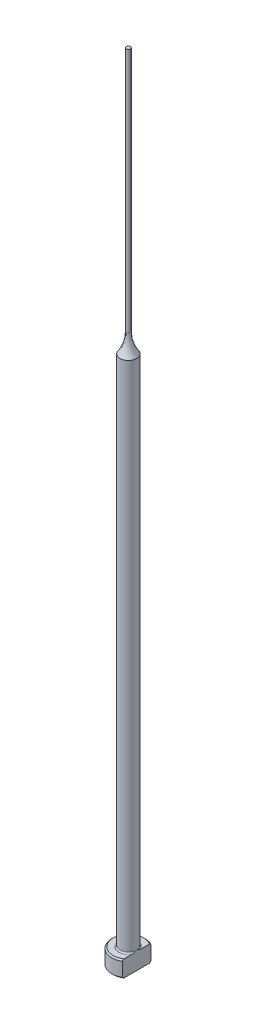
ISO-10303-21;
HEADER;
FILE_DESCRIPTION(('STEP AP214'),'2;1');
FILE_NAME('part.step','',(''),(''),'','','');
FILE_SCHEMA(('AUTOMOTIVE_DESIGN { 1 0 10303 214 1 1 1 1 }'));
ENDSEC;
DATA;
#1=APPLICATION_CONTEXT('core data for automotive mechanical design processes');
#2=APPLICATION_PROTOCOL_DEFINITION('international standard','automotive_design',2000,#1);
#3=PRODUCT_CONTEXT('',#1,'mechanical');
#4=PRODUCT('Part','Part','',(#3));
#5=PRODUCT_RELATED_PRODUCT_CATEGORY('part','',(#4));
#6=PRODUCT_DEFINITION_FORMATION('','',#4);
#7=PRODUCT_DEFINITION_CONTEXT('part definition',#1,'design');
#8=PRODUCT_DEFINITION('design','',#6,#7);
#9=PRODUCT_DEFINITION_SHAPE('','',#8);
#10=(LENGTH_UNIT() NAMED_UNIT(*) SI_UNIT(.MILLI.,.METRE.));
#11=(NAMED_UNIT(*) PLANE_ANGLE_UNIT() SI_UNIT($,.RADIAN.));
#12=(NAMED_UNIT(*) SI_UNIT($,.STERADIAN.) SOLID_ANGLE_UNIT());
#13=UNCERTAINTY_MEASURE_WITH_UNIT(LENGTH_MEASURE(1.E-05),#10,'distance_accuracy_value','');
#14=(GEOMETRIC_REPRESENTATION_CONTEXT(3) GLOBAL_UNCERTAINTY_ASSIGNED_CONTEXT((#13)) GLOBAL_UNIT_ASSIGNED_CONTEXT((#10,
#11,#12)) REPRESENTATION_CONTEXT('',''));
#15=CARTESIAN_POINT('',(0.,0.,0.));
#16=DIRECTION('',(0.,0.,1.));
#17=DIRECTION('',(1.,0.,0.));
#18=AXIS2_PLACEMENT_3D('',#15,#16,#17);
#19=CARTESIAN_POINT('',(-3.17499999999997,3.175,0.));
#20=DIRECTION('',(0.,1.,0.));
#21=DIRECTION('',(0.,0.,1.));
#22=AXIS2_PLACEMENT_3D('',#19,#20,#21);
#23=PLANE('',#22);
#24=CARTESIAN_POINT('',(0.,3.175,0.));
#25=DIRECTION('',(0.,1.,0.));
#26=DIRECTION('',(0.,0.,1.));
#27=AXIS2_PLACEMENT_3D('',#24,#25,#26);
#28=CIRCLE('',#27,2.92099999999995);
#29=CARTESIAN_POINT('',(1.58749999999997,3.175,-2.45195529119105));
#30=VERTEX_POINT('',#29);
#31=CARTESIAN_POINT('',(1.58749999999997,3.175,2.45195529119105));
#32=VERTEX_POINT('',#31);
#33=EDGE_CURVE('E105',#30,#32,#28,.T.);
#34=ORIENTED_EDGE('',*,*,#33,.T.);
#35=DIRECTION('',(0.,0.,1.));
#36=VECTOR('',#35,1.);
#37=CARTESIAN_POINT('',(1.58749999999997,3.17500000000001,2.74963065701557));
#38=LINE('',#37,#36);
#39=CARTESIAN_POINT('',(1.58749999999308,3.175,0.933255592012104));
#40=VERTEX_POINT('',#39);
#41=EDGE_CURVE('E126',#40,#32,#38,.T.);
#42=ORIENTED_EDGE('',*,*,#41,.F.);
#43=CARTESIAN_POINT('',(0.,3.175,0.));
#44=DIRECTION('',(0.,1.,0.));
#45=DIRECTION('',(0.,0.,1.));
#46=AXIS2_PLACEMENT_3D('',#43,#44,#45);
#47=CIRCLE('',#46,1.84149999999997);
#48=CARTESIAN_POINT('',(1.58749999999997,3.17500000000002,-0.933255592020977));
#49=VERTEX_POINT('',#48);
#50=EDGE_CURVE('E11',#40,#49,#47,.F.);
#51=ORIENTED_EDGE('',*,*,#50,.T.);
#52=EDGE_CURVE('E52',#30,#49,#38,.T.);
#53=ORIENTED_EDGE('',*,*,#52,.F.);
#54=EDGE_LOOP('',(#34,#42,#51,#53));
#55=FACE_BOUND('',#54,.T.);
#56=ADVANCED_FACE('F32',(#55),#23,.T.);
#57=CARTESIAN_POINT('',(0.,259.958771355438,0.));
#58=DIRECTION('',(0.,1.,0.));
#59=DIRECTION('',(0.,0.,1.));
#60=AXIS2_PLACEMENT_3D('',#57,#58,#59);
#61=CYLINDRICAL_SURFACE('',#60,3.17499999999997);
#62=CARTESIAN_POINT('',(0.,2.92100000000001,0.));
#63=DIRECTION('',(0.,1.,0.));
#64=DIRECTION('',(0.,0.,1.));
#65=AXIS2_PLACEMENT_3D('',#62,#63,#64);
#66=CIRCLE('',#65,3.17499999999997);
#67=CARTESIAN_POINT('',(1.58749999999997,2.92100000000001,2.74963065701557));
#68=VERTEX_POINT('',#67);
#69=CARTESIAN_POINT('',(1.58749999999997,2.92100000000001,-2.74963065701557));
#70=VERTEX_POINT('',#69);
#71=EDGE_CURVE('E98',#68,#70,#66,.F.);
#72=ORIENTED_EDGE('',*,*,#71,.T.);
#73=DIRECTION('',(0.,-1.,0.));
#74=VECTOR('',#73,1.);
#75=CARTESIAN_POINT('',(1.58749999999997,152.401,-2.74963065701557));
#76=LINE('',#75,#74);
#77=CARTESIAN_POINT('',(1.58749999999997,0.254000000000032,-2.74963065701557));
#78=VERTEX_POINT('',#77);
#79=EDGE_CURVE('E141',#70,#78,#76,.T.);
#80=ORIENTED_EDGE('',*,*,#79,.T.);
#81=CARTESIAN_POINT('',(0.,0.254000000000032,0.));
#82=DIRECTION('',(0.,-1.,0.));
#83=DIRECTION('',(0.,0.,-1.));
#84=AXIS2_PLACEMENT_3D('',#81,#82,#83);
#85=CIRCLE('',#84,3.17499999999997);
#86=CARTESIAN_POINT('',(1.58749999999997,0.254000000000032,2.74963065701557));
#87=VERTEX_POINT('',#86);
#88=EDGE_CURVE('E95',#78,#87,#85,.F.);
#89=ORIENTED_EDGE('',*,*,#88,.T.);
#90=DIRECTION('',(0.,-1.,0.));
#91=VECTOR('',#90,1.);
#92=CARTESIAN_POINT('',(1.58749999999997,152.401,2.74963065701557));
#93=LINE('',#92,#91);
#94=EDGE_CURVE('E88',#68,#87,#93,.T.);
#95=ORIENTED_EDGE('',*,*,#94,.F.);
#96=EDGE_LOOP('',(#72,#80,#89,#95));
#97=FACE_BOUND('',#96,.T.);
#98=ADVANCED_FACE('F191',(#97),#61,.T.);
#99=CARTESIAN_POINT('',(0.,0.,0.));
#100=DIRECTION('',(0.,-1.,0.));
#101=DIRECTION('',(0.,0.,-1.));
#102=AXIS2_PLACEMENT_3D('',#99,#100,#101);
#103=PLANE('',#102);
#104=CARTESIAN_POINT('',(0.,0.,0.));
#105=DIRECTION('',(0.,-1.,0.));
#106=DIRECTION('',(0.,0.,-1.));
#107=AXIS2_PLACEMENT_3D('',#104,#105,#106);
#108=CIRCLE('',#107,2.92099999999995);
#109=CARTESIAN_POINT('',(1.58749999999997,0.,2.45195529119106));
#110=VERTEX_POINT('',#109);
#111=CARTESIAN_POINT('',(1.58749999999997,0.,-2.45195529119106));
#112=VERTEX_POINT('',#111);
#113=EDGE_CURVE('E93',#110,#112,#108,.T.);
#114=ORIENTED_EDGE('',*,*,#113,.T.);
#115=DIRECTION('',(0.,0.,1.));
#116=VECTOR('',#115,1.);
#117=CARTESIAN_POINT('',(1.58749999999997,0.,2.74963065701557));
#118=LINE('',#117,#116);
#119=EDGE_CURVE('E78',#112,#110,#118,.T.);
#120=ORIENTED_EDGE('',*,*,#119,.T.);
#121=EDGE_LOOP('',(#114,#120));
#122=FACE_BOUND('',#121,.T.);
#123=ADVANCED_FACE('F97',(#122),#103,.T.);
#124=CARTESIAN_POINT('',(0.,3.17499999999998,0.));
#125=DIRECTION('',(0.,-1.,0.));
#126=DIRECTION('',(0.,0.,-1.));
#127=AXIS2_PLACEMENT_3D('',#124,#125,#126);
#128=CONICAL_SURFACE('',#127,2.92099999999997,0.7853981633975);
#129=ORIENTED_EDGE('',*,*,#71,.F.);
#130=CARTESIAN_POINT('',(1.58749999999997,-0.161620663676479,-6.0529050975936));
#131=CARTESIAN_POINT('',(1.58749999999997,-0.0288893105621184,-5.91567682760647));
#132=CARTESIAN_POINT('',(1.58749999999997,0.103699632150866,-5.77831035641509));
#133=CARTESIAN_POINT('',(1.58749999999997,0.36850839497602,-5.5032187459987));
#134=CARTESIAN_POINT('',(1.58749999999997,0.500728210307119,-5.36549360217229));
#135=CARTESIAN_POINT('',(1.58749999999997,0.764778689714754,-5.08953516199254));
#136=CARTESIAN_POINT('',(1.58749999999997,0.896609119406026,-4.95130164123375));
#137=CARTESIAN_POINT('',(1.58749999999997,1.15968706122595,-4.67428233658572));
#138=CARTESIAN_POINT('',(1.58749999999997,1.29093457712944,-4.53549655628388));
#139=CARTESIAN_POINT('',(1.58749999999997,1.55007705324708,-4.25997724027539));
#140=CARTESIAN_POINT('',(1.58749999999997,1.67798684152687,-4.12325766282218));
#141=CARTESIAN_POINT('',(1.58749999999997,1.93284861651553,-3.84892898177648));
#142=CARTESIAN_POINT('',(1.58749999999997,2.05980060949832,-3.71131988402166));
#143=CARTESIAN_POINT('',(1.58749999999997,2.31237508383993,-3.43493978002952));
#144=CARTESIAN_POINT('',(1.58749999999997,2.43799784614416,-3.29616903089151));
#145=CARTESIAN_POINT('',(1.58749999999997,2.68741369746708,-3.01699558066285));
#146=CARTESIAN_POINT('',(1.58749999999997,2.81120686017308,-2.87659294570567));
#147=CARTESIAN_POINT('',(1.58749999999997,3.0087586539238,-2.6481670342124));
#148=CARTESIAN_POINT('',(1.58749999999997,3.08336151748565,-2.56087478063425));
#149=CARTESIAN_POINT('',(1.58749999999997,3.23123871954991,-2.38515423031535));
#150=CARTESIAN_POINT('',(1.58749999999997,3.30451292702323,-2.29672582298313));
#151=CARTESIAN_POINT('',(1.58749999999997,3.45004422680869,-2.1174740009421));
#152=CARTESIAN_POINT('',(1.58749999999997,3.52228237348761,-2.02663514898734));
#153=CARTESIAN_POINT('',(1.58749999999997,3.6642309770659,-1.8430252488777));
#154=CARTESIAN_POINT('',(1.58749999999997,3.73394203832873,-1.75025467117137));
#155=CARTESIAN_POINT('',(1.58749999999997,3.87080633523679,-1.56067475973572));
#156=CARTESIAN_POINT('',(1.58749999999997,3.93790459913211,-1.46382547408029));
#157=CARTESIAN_POINT('',(1.58749999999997,4.06669147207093,-1.26632594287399));
#158=CARTESIAN_POINT('',(1.58749999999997,4.12837264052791,-1.16567073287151));
#159=CARTESIAN_POINT('',(1.58749999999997,4.2140225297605,-1.01165766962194));
#160=CARTESIAN_POINT('',(1.58749999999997,4.24127929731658,-0.960142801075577));
#161=CARTESIAN_POINT('',(1.58749999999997,4.29309798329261,-0.855780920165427));
#162=CARTESIAN_POINT('',(1.58749999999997,4.31765941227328,-0.802933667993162));
#163=CARTESIAN_POINT('',(1.58749999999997,4.38614656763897,-0.64246114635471));
#164=CARTESIAN_POINT('',(1.58749999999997,4.42510149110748,-0.532518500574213));
#165=CARTESIAN_POINT('',(1.58749999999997,4.46726244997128,-0.367680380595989));
#166=CARTESIAN_POINT('',(1.58749999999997,4.47844427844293,-0.314802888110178));
#167=CARTESIAN_POINT('',(1.58749999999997,4.495766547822,-0.2082097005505));
#168=CARTESIAN_POINT('',(1.58749999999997,4.50190743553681,-0.154494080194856));
#169=CARTESIAN_POINT('',(1.58749999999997,4.50871296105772,-0.0468792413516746));
#170=CARTESIAN_POINT('',(1.58749999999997,4.50939451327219,0.0070188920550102));
#171=CARTESIAN_POINT('',(1.58749999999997,4.50527679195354,0.114606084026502));
#172=CARTESIAN_POINT('',(1.58749999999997,4.50047706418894,0.168295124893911));
#173=CARTESIAN_POINT('',(1.58749999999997,4.48579689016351,0.274485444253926));
#174=CARTESIAN_POINT('',(1.58749999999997,4.47596081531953,0.326992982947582));
#175=CARTESIAN_POINT('',(1.58749999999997,4.45181809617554,0.430974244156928));
#176=CARTESIAN_POINT('',(1.58749999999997,4.43750969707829,0.48244755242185));
#177=CARTESIAN_POINT('',(1.58749999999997,4.40502489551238,0.584460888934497));
#178=CARTESIAN_POINT('',(1.58749999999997,4.38682724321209,0.634994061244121));
#179=CARTESIAN_POINT('',(1.58749999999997,4.34729308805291,0.734789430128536));
#180=CARTESIAN_POINT('',(1.58749999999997,4.32595722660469,0.784051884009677));
#181=CARTESIAN_POINT('',(1.58749999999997,4.25791922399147,0.930549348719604));
#182=CARTESIAN_POINT('',(1.58749999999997,4.20736047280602,1.02598802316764));
#183=CARTESIAN_POINT('',(1.58749999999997,4.09955451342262,1.2130431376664));
#184=CARTESIAN_POINT('',(1.58749999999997,4.04229912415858,1.30465471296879));
#185=CARTESIAN_POINT('',(1.58749999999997,3.9230874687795,1.4852621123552));
#186=CARTESIAN_POINT('',(1.58749999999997,3.86111349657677,1.57424615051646));
#187=CARTESIAN_POINT('',(1.58749999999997,3.73408621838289,1.74990003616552));
#188=CARTESIAN_POINT('',(1.58749999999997,3.66903444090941,1.8365709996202));
#189=CARTESIAN_POINT('',(1.58749999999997,3.53583371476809,2.00931764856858));
#190=CARTESIAN_POINT('',(1.58749999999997,3.46765527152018,2.09537048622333));
#191=CARTESIAN_POINT('',(1.58749999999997,3.32960643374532,2.26611736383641));
#192=CARTESIAN_POINT('',(1.58749999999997,3.25973586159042,2.35081125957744));
#193=CARTESIAN_POINT('',(1.58749999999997,3.04858139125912,2.60290121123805));
#194=CARTESIAN_POINT('',(1.58749999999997,2.90542388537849,2.76872537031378));
#195=CARTESIAN_POINT('',(1.58749999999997,2.64069522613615,3.06970913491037));
#196=CARTESIAN_POINT('',(1.58749999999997,2.5195945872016,3.20528660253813));
#197=CARTESIAN_POINT('',(1.58749999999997,2.275904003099,3.47510321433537));
#198=CARTESIAN_POINT('',(1.58749999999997,2.15331401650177,3.60934232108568));
#199=CARTESIAN_POINT('',(1.58749999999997,1.90694239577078,3.87695374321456));
#200=CARTESIAN_POINT('',(1.58749999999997,1.78315974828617,4.01032512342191));
#201=CARTESIAN_POINT('',(1.58749999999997,1.53478104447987,4.2763088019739));
#202=CARTESIAN_POINT('',(1.58749999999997,1.41018498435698,4.40892109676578));
#203=CARTESIAN_POINT('',(1.58749999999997,1.0457468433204,4.79499418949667));
#204=CARTESIAN_POINT('',(1.58749999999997,0.805076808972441,5.04767313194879));
#205=CARTESIAN_POINT('',(1.58749999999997,0.443121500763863,5.42550911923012));
#206=CARTESIAN_POINT('',(1.58749999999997,0.322378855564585,5.55118772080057));
#207=CARTESIAN_POINT('',(1.58749999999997,0.0805914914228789,5.80225207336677));
#208=CARTESIAN_POINT('',(1.58749999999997,-0.0404532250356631,5.92763782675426));
#209=CARTESIAN_POINT('',(1.58749999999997,-0.161620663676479,6.0529050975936));
#210=B_SPLINE_CURVE_WITH_KNOTS('',3,(#130,#131,#132,#133,#134,#135,#136,#137,#138,#139,#140,
#141,#142,#143,#144,#145,#146,#147,#148,#149,#150,#151,#152,#153,#154,#155,#156,#157,#158,#159,
#160,#161,#162,#163,#164,#165,#166,#167,#168,#169,#170,#171,#172,#173,#174,#175,#176,#177,#178,
#179,#180,#181,#182,#183,#184,#185,#186,#187,#188,#189,#190,#191,#192,#193,#194,#195,#196,#197,
#198,#199,#200,#201,#202,#203,#204,#205,#206,#207,#208,#209),.UNSPECIFIED.,.F.,.F.,(4,2,2,2,2,2,
2,2,2,2,2,2,2,2,2,2,2,2,2,2,2,2,2,2,2,2,2,2,2,2,2,2,2,2,2,2,2,2,2,4),(0.,0.572750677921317,
1.14550874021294,1.71856057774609,2.29160869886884,2.85328006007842,3.41494773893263,
3.97649423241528,4.53801804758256,4.88249307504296,5.22700189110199,5.57515326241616,
5.92322081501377,6.27657800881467,6.63041319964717,6.80518126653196,6.97998101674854,
7.32824262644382,7.49018491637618,7.65211285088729,7.813538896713,7.97497832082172,
8.13501929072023,8.29512313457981,8.4561251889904,8.61709438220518,8.94062993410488,
9.26456495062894,9.58978187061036,9.91483894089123,10.2441741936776,10.5735441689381,
11.2306812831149,11.7760337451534,12.3214014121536,12.8672825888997,13.4131663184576,
14.4600164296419,14.9828595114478,15.505698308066),.UNSPECIFIED.);
#211=EDGE_CURVE('E118',#32,#68,#210,.T.);
#212=ORIENTED_EDGE('',*,*,#211,.F.);
#213=ORIENTED_EDGE('',*,*,#33,.F.);
#214=EDGE_CURVE('E117',#70,#30,#210,.T.);
#215=ORIENTED_EDGE('',*,*,#214,.F.);
#216=EDGE_LOOP('',(#129,#212,#213,#215));
#217=FACE_BOUND('',#216,.T.);
#218=ADVANCED_FACE('F162',(#217),#128,.T.);
#219=CARTESIAN_POINT('',(0.,0.254000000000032,0.));
#220=DIRECTION('',(0.,1.,0.));
#221=DIRECTION('',(0.,0.,1.));
#222=AXIS2_PLACEMENT_3D('',#219,#220,#221);
#223=CONICAL_SURFACE('',#222,3.17499999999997,0.785398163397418);
#224=ORIENTED_EDGE('',*,*,#88,.F.);
#225=CARTESIAN_POINT('',(1.58749999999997,3.33662066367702,6.0529050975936));
#226=CARTESIAN_POINT('',(1.58749999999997,3.20388931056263,5.91567682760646));
#227=CARTESIAN_POINT('',(1.58749999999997,3.0713003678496,5.77831035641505));
#228=CARTESIAN_POINT('',(1.58749999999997,2.80649160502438,5.50321874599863));
#229=CARTESIAN_POINT('',(1.58749999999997,2.67427178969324,5.36549360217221));
#230=CARTESIAN_POINT('',(1.58749999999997,2.41022131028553,5.08953516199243));
#231=CARTESIAN_POINT('',(1.58749999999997,2.27839088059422,4.95130164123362));
#232=CARTESIAN_POINT('',(1.58749999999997,2.01531293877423,4.67428233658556));
#233=CARTESIAN_POINT('',(1.58749999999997,1.8840654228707,4.5354965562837));
#234=CARTESIAN_POINT('',(1.58749999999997,1.62492294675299,4.25997724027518));
#235=CARTESIAN_POINT('',(1.58749999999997,1.49701315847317,4.12325766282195));
#236=CARTESIAN_POINT('',(1.58749999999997,1.24215138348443,3.84892898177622));
#237=CARTESIAN_POINT('',(1.58749999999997,1.11519939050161,3.71131988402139));
#238=CARTESIAN_POINT('',(1.58749999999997,0.862624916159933,3.43493978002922));
#239=CARTESIAN_POINT('',(1.58749999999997,0.737002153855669,3.29616903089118));
#240=CARTESIAN_POINT('',(1.58749999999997,0.487586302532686,3.01699558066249));
#241=CARTESIAN_POINT('',(1.58749999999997,0.363793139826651,2.8765929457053));
#242=CARTESIAN_POINT('',(1.58749999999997,0.1662413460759,2.64816703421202));
#243=CARTESIAN_POINT('',(1.58749999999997,0.0916384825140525,2.56087478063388));
#244=CARTESIAN_POINT('',(1.58749999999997,-0.0562387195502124,2.385154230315));
#245=CARTESIAN_POINT('',(1.58749999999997,-0.129512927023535,2.29672582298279));
#246=CARTESIAN_POINT('',(1.58749999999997,-0.275044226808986,2.11747400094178));
#247=CARTESIAN_POINT('',(1.58749999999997,-0.34728237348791,2.02663514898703));
#248=CARTESIAN_POINT('',(1.58749999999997,-0.489230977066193,1.84302524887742));
#249=CARTESIAN_POINT('',(1.58749999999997,-0.558942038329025,1.75025467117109));
#250=CARTESIAN_POINT('',(1.58749999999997,-0.695806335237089,1.56067475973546));
#251=CARTESIAN_POINT('',(1.58749999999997,-0.762904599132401,1.46382547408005));
#252=CARTESIAN_POINT('',(1.58749999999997,-0.89169147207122,1.26632594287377));
#253=CARTESIAN_POINT('',(1.58749999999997,-0.953372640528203,1.16567073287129));
#254=CARTESIAN_POINT('',(1.58749999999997,-1.03902252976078,1.01165766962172));
#255=CARTESIAN_POINT('',(1.58749999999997,-1.06627929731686,0.960142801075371));
#256=CARTESIAN_POINT('',(1.58749999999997,-1.11809798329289,0.855780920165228));
#257=CARTESIAN_POINT('',(1.58749999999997,-1.14265941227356,0.802933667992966));
#258=CARTESIAN_POINT('',(1.58749999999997,-1.21114656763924,0.642461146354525));
#259=CARTESIAN_POINT('',(1.58749999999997,-1.25010149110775,0.532518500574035));
#260=CARTESIAN_POINT('',(1.58749999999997,-1.29226244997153,0.36768038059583));
#261=CARTESIAN_POINT('',(1.58749999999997,-1.30344427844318,0.31480288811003));
#262=CARTESIAN_POINT('',(1.58749999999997,-1.32076654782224,0.208209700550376));
#263=CARTESIAN_POINT('',(1.58749999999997,-1.32690743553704,0.154494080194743));
#264=CARTESIAN_POINT('',(1.58749999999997,-1.33371296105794,0.0468792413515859));
#265=CARTESIAN_POINT('',(1.58749999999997,-1.33439451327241,-0.0070188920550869));
#266=CARTESIAN_POINT('',(1.58749999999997,-1.33027679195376,-0.114606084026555));
#267=CARTESIAN_POINT('',(1.58749999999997,-1.32547706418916,-0.168295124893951));
#268=CARTESIAN_POINT('',(1.58749999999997,-1.31079689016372,-0.274485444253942));
#269=CARTESIAN_POINT('',(1.58749999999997,-1.30096081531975,-0.326992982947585));
#270=CARTESIAN_POINT('',(1.58749999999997,-1.27681809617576,-0.430974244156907));
#271=CARTESIAN_POINT('',(1.58749999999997,-1.26250969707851,-0.482447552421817));
#272=CARTESIAN_POINT('',(1.58749999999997,-1.2300248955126,-0.584460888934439));
#273=CARTESIAN_POINT('',(1.58749999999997,-1.21182724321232,-0.634994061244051));
#274=CARTESIAN_POINT('',(1.58749999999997,-1.17229308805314,-0.734789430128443));
#275=CARTESIAN_POINT('',(1.58749999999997,-1.15095722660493,-0.784051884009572));
#276=CARTESIAN_POINT('',(1.58749999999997,-1.08291922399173,-0.93054934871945));
#277=CARTESIAN_POINT('',(1.58749999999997,-1.0323604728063,-1.02598802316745));
#278=CARTESIAN_POINT('',(1.58749999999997,-0.92455451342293,-1.21304313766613));
#279=CARTESIAN_POINT('',(1.58749999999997,-0.867299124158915,-1.30465471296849));
#280=CARTESIAN_POINT('',(1.58749999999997,-0.748087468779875,-1.48526211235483));
#281=CARTESIAN_POINT('',(1.58749999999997,-0.686113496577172,-1.57424615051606));
#282=CARTESIAN_POINT('',(1.58749999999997,-0.559086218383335,-1.74990003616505));
#283=CARTESIAN_POINT('',(1.58749999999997,-0.494034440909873,-1.83657099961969));
#284=CARTESIAN_POINT('',(1.58749999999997,-0.360833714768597,-2.00931764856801));
#285=CARTESIAN_POINT('',(1.58749999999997,-0.292655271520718,-2.09537048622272));
#286=CARTESIAN_POINT('',(1.58749999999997,-0.154606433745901,-2.26611736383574));
#287=CARTESIAN_POINT('',(1.58749999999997,-0.084735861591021,-2.35081125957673));
#288=CARTESIAN_POINT('',(1.58749999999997,0.126418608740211,-2.60290121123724));
#289=CARTESIAN_POINT('',(1.58749999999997,0.26957611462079,-2.76872537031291));
#290=CARTESIAN_POINT('',(1.58749999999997,0.534304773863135,-3.06970913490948));
#291=CARTESIAN_POINT('',(1.58749999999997,0.655405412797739,-3.20528660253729));
#292=CARTESIAN_POINT('',(1.58749999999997,0.899095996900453,-3.47510321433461));
#293=CARTESIAN_POINT('',(1.58749999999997,1.02168598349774,-3.60934232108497));
#294=CARTESIAN_POINT('',(1.58749999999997,1.26805760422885,-3.87695374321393));
#295=CARTESIAN_POINT('',(1.58749999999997,1.39184025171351,-4.01032512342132));
#296=CARTESIAN_POINT('',(1.58749999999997,1.64021895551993,-4.2763088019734));
#297=CARTESIAN_POINT('',(1.58749999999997,1.76481501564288,-4.40892109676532));
#298=CARTESIAN_POINT('',(1.58749999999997,2.12925315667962,-4.79499418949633));
#299=CARTESIAN_POINT('',(1.58749999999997,2.36992319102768,-5.04767313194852));
#300=CARTESIAN_POINT('',(1.58749999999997,2.73187849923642,-5.42550911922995));
#301=CARTESIAN_POINT('',(1.58749999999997,2.85262114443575,-5.55118772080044));
#302=CARTESIAN_POINT('',(1.58749999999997,3.09440850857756,-5.8022520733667));
#303=CARTESIAN_POINT('',(1.58749999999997,3.21545322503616,-5.92763782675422));
#304=CARTESIAN_POINT('',(1.58749999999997,3.33662066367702,-6.0529050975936));
#305=B_SPLINE_CURVE_WITH_KNOTS('',3,(#225,#226,#227,#228,#229,#230,#231,#232,#233,#234,#235,
#236,#237,#238,#239,#240,#241,#242,#243,#244,#245,#246,#247,#248,#249,#250,#251,#252,#253,#254,
#255,#256,#257,#258,#259,#260,#261,#262,#263,#264,#265,#266,#267,#268,#269,#270,#271,#272,#273,
#274,#275,#276,#277,#278,#279,#280,#281,#282,#283,#284,#285,#286,#287,#288,#289,#290,#291,#292,
#293,#294,#295,#296,#297,#298,#299,#300,#301,#302,#303,#304),.UNSPECIFIED.,.F.,.F.,(4,2,2,2,2,2,
2,2,2,2,2,2,2,2,2,2,2,2,2,2,2,2,2,2,2,2,2,2,2,2,2,2,2,2,2,2,2,2,2,4),(0.,0.572750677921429,
1.14550874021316,1.71856057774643,2.29160869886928,2.85328006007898,3.41494773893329,
3.97649423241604,4.53801804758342,4.8824930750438,5.22700189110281,5.57515326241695,
5.92322081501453,6.27657800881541,6.63041319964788,6.80518126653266,6.97998101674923,
7.32824262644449,7.49018491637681,7.65211285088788,7.81353889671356,7.97497832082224,
8.13501929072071,8.29512313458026,8.45612518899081,8.61709438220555,8.94062993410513,
9.26456495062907,9.58978187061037,9.91483894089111,10.2441741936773,10.5735441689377,
11.2306812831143,11.776033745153,12.3214014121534,12.8672825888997,13.4131663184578,
14.4600164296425,14.9828595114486,15.505698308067),.UNSPECIFIED.);
#306=EDGE_CURVE('E81',#112,#78,#305,.T.);
#307=ORIENTED_EDGE('',*,*,#306,.F.);
#308=ORIENTED_EDGE('',*,*,#113,.F.);
#309=EDGE_CURVE('E84',#87,#110,#305,.T.);
#310=ORIENTED_EDGE('',*,*,#309,.F.);
#311=EDGE_LOOP('',(#224,#307,#308,#310));
#312=FACE_BOUND('',#311,.T.);
#313=ADVANCED_FACE('F92',(#312),#223,.T.);
#314=CARTESIAN_POINT('',(0.,3.42900000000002,0.));
#315=DIRECTION('',(0.,1.,0.));
#316=DIRECTION('',(0.,0.,1.));
#317=AXIS2_PLACEMENT_3D('',#314,#315,#316);
#318=TOROIDAL_SURFACE('',#317,1.84149999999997,0.254);
#319=CARTESIAN_POINT('',(1.58749999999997,3.42900000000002,0.));
#320=CARTESIAN_POINT('',(1.58749999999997,3.42899942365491,-1.9220514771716E-10));
#321=CARTESIAN_POINT('',(1.58749999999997,3.42899884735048,-1.2261161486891E-07));
#322=CARTESIAN_POINT('',(1.58749999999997,3.42899773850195,-5.09676365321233E-07));
#323=CARTESIAN_POINT('',(1.58749999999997,3.42899720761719,-7.78176328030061E-07));
#324=CARTESIAN_POINT('',(1.58749999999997,3.42899614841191,-1.42307272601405E-06));
#325=CARTESIAN_POINT('',(1.58749999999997,3.42899562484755,-1.80713867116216E-06));
#326=CARTESIAN_POINT('',(1.58749999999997,3.42899463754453,-2.63494846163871E-06));
#327=CARTESIAN_POINT('',(1.58749999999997,3.42899417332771,-3.07814756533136E-06));
#328=CARTESIAN_POINT('',(1.58749999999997,3.42899261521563,-4.66897357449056E-06));
#329=CARTESIAN_POINT('',(1.58749999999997,3.42899159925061,-5.89404908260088E-06));
#330=CARTESIAN_POINT('',(1.58749999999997,3.42898979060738,-8.42427511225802E-06));
#331=CARTESIAN_POINT('',(1.58749999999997,3.42898899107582,-9.7248057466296E-06));
#332=CARTESIAN_POINT('',(1.58749999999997,3.42898598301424,-1.48060601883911E-05));
#333=CARTESIAN_POINT('',(1.58749999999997,3.42898393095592,-1.86838281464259E-05));
#334=CARTESIAN_POINT('',(1.58749999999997,3.42898057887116,-2.63261117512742E-05));
#335=CARTESIAN_POINT('',(1.58749999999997,3.42897922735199,-3.00687417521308E-05));
#336=CARTESIAN_POINT('',(1.58749999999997,3.42897347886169,-4.60276298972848E-05));
#337=CARTESIAN_POINT('',(1.58749999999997,3.42896911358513,-5.8247019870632E-05));
#338=CARTESIAN_POINT('',(1.58749999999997,3.42896211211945,-8.11070097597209E-05));
#339=CARTESIAN_POINT('',(1.58749999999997,3.42895931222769,-9.16953114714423E-05));
#340=CARTESIAN_POINT('',(1.58749999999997,3.42893712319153,-0.000168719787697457));
#341=CARTESIAN_POINT('',(1.58749999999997,3.42890881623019,-0.000232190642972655));
#342=CARTESIAN_POINT('',(1.58749999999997,3.42880276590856,-0.000479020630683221));
#343=CARTESIAN_POINT('',(1.58749999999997,3.42873165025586,-0.00066443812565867));
#344=CARTESIAN_POINT('',(1.58749999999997,3.42845137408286,-0.0013844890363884));
#345=CARTESIAN_POINT('',(1.58749999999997,3.42823526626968,-0.00191701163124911));
#346=CARTESIAN_POINT('',(1.58749999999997,3.42735449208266,-0.00409774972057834));
#347=CARTESIAN_POINT('',(1.58749999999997,3.42669768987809,-0.00574830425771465));
#348=CARTESIAN_POINT('',(1.58749999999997,3.4174405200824,-0.0289985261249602));
#349=CARTESIAN_POINT('',(1.58749999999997,3.40878325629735,-0.0505816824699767));
#350=CARTESIAN_POINT('',(1.58749999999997,3.39189297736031,-0.0929947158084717));
#351=CARTESIAN_POINT('',(1.58749999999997,3.38365605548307,-0.11382315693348));
#352=CARTESIAN_POINT('',(1.58749999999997,3.36635393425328,-0.157956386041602));
#353=CARTESIAN_POINT('',(1.58749999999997,3.35730391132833,-0.181267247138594));
#354=CARTESIAN_POINT('',(1.58749999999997,3.33936775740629,-0.228222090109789));
#355=CARTESIAN_POINT('',(1.58749999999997,3.33048420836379,-0.25186705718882));
#356=CARTESIAN_POINT('',(1.58749999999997,3.30894496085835,-0.310512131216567));
#357=CARTESIAN_POINT('',(1.58749999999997,3.29649449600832,-0.345588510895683));
#358=CARTESIAN_POINT('',(1.58749999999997,3.27296975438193,-0.415278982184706));
#359=CARTESIAN_POINT('',(1.58749999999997,3.26186987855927,-0.449884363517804));
#360=CARTESIAN_POINT('',(1.58749999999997,3.2395832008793,-0.524471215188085));
#361=CARTESIAN_POINT('',(1.58749999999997,3.22860862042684,-0.564517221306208));
#362=CARTESIAN_POINT('',(1.58749999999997,3.20902534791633,-0.645529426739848));
#363=CARTESIAN_POINT('',(1.58749999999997,3.20043582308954,-0.686500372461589));
#364=CARTESIAN_POINT('',(1.58749999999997,3.18611712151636,-0.771546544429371));
#365=CARTESIAN_POINT('',(1.58749999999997,3.18059550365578,-0.815658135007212));
#366=CARTESIAN_POINT('',(1.58749999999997,3.17455396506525,-0.904117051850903));
#367=CARTESIAN_POINT('',(1.58749999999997,3.17401361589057,-0.948462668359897));
#368=CARTESIAN_POINT('',(1.58749999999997,3.17898948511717,-1.02531896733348));
#369=CARTESIAN_POINT('',(1.58749999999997,3.1829739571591,-1.05792141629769));
#370=CARTESIAN_POINT('',(1.58749999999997,3.19569167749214,-1.12184393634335));
#371=CARTESIAN_POINT('',(1.58749999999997,3.20436049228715,-1.1531753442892));
#372=CARTESIAN_POINT('',(1.58749999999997,3.22236152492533,-1.19946468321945));
#373=CARTESIAN_POINT('',(1.58749999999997,3.2295150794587,-1.21526783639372));
#374=CARTESIAN_POINT('',(1.58749999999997,3.24587062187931,-1.24583726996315));
#375=CARTESIAN_POINT('',(1.58749999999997,3.25507530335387,-1.26060215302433));
#376=CARTESIAN_POINT('',(1.58749999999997,3.27378481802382,-1.28575815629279));
#377=CARTESIAN_POINT('',(1.58749999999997,3.28289001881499,-1.29644383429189));
#378=CARTESIAN_POINT('',(1.58749999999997,3.30268460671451,-1.31623154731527));
#379=CARTESIAN_POINT('',(1.58749999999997,3.31337067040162,-1.32533681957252));
#380=CARTESIAN_POINT('',(1.58749999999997,3.33349977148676,-1.33941140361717));
#381=CARTESIAN_POINT('',(1.58749999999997,3.34261446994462,-1.34484814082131));
#382=CARTESIAN_POINT('',(1.58749999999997,3.36161455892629,-1.35416329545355));
#383=CARTESIAN_POINT('',(1.58749999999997,3.37149946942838,-1.35804267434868));
#384=CARTESIAN_POINT('',(1.58749999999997,3.39188678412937,-1.36398436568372));
#385=CARTESIAN_POINT('',(1.58749999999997,3.40239309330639,-1.36603350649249));
#386=CARTESIAN_POINT('',(1.58749999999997,3.42360372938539,-1.3680840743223));
#387=CARTESIAN_POINT('',(1.58749999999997,3.43430795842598,-1.36808648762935));
#388=CARTESIAN_POINT('',(1.58749999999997,3.45433283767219,-1.36616208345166));
#389=CARTESIAN_POINT('',(1.58749999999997,3.46367506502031,-1.36444960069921));
#390=CARTESIAN_POINT('',(1.58749999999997,3.48195519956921,-1.35953338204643));
#391=CARTESIAN_POINT('',(1.58749999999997,3.49089304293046,-1.3563294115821));
#392=CARTESIAN_POINT('',(1.58749999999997,3.50850302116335,-1.34848006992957));
#393=CARTESIAN_POINT('',(1.58749999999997,3.5171531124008,-1.34378578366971));
#394=CARTESIAN_POINT('',(1.58749999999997,3.53371257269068,-1.33324445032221));
#395=CARTESIAN_POINT('',(1.58749999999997,3.54162163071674,-1.32739692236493));
#396=CARTESIAN_POINT('',(1.58749999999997,3.56107121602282,-1.31107304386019));
#397=CARTESIAN_POINT('',(1.58749999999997,3.57202221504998,-1.29989286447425));
#398=CARTESIAN_POINT('',(1.58749999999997,3.59202509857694,-1.27593566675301));
#399=CARTESIAN_POINT('',(1.58749999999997,3.60107086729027,-1.26315370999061));
#400=CARTESIAN_POINT('',(1.58749999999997,3.62186023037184,-1.22930733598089));
#401=CARTESIAN_POINT('',(1.58749999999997,3.63240584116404,-1.20751096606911));
#402=CARTESIAN_POINT('',(1.58749999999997,3.65004643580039,-1.16266144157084));
#403=CARTESIAN_POINT('',(1.58749999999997,3.65714435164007,-1.13960937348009));
#404=CARTESIAN_POINT('',(1.58749999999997,3.67265428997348,-1.07603916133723));
#405=CARTESIAN_POINT('',(1.58749999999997,3.67834921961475,-1.03486686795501));
#406=CARTESIAN_POINT('',(1.58749999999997,3.68382880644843,-0.951558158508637));
#407=CARTESIAN_POINT('',(1.58749999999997,3.68350976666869,-0.909417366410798));
#408=CARTESIAN_POINT('',(1.58749999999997,3.67745397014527,-0.811383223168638));
#409=CARTESIAN_POINT('',(1.58749999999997,3.66993873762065,-0.755610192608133));
#410=CARTESIAN_POINT('',(1.58749999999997,3.64933373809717,-0.644937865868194));
#411=CARTESIAN_POINT('',(1.58749999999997,3.63621897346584,-0.59004364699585));
#412=CARTESIAN_POINT('',(1.58749999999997,3.60740922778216,-0.485757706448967));
#413=CARTESIAN_POINT('',(1.58749999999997,3.59201096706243,-0.436281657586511));
#414=CARTESIAN_POINT('',(1.58749999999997,3.55922497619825,-0.338551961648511));
#415=CARTESIAN_POINT('',(1.58749999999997,3.5418584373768,-0.290291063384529));
#416=CARTESIAN_POINT('',(1.58749999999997,3.51760237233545,-0.225557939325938));
#417=CARTESIAN_POINT('',(1.58749999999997,3.51126413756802,-0.208874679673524));
#418=CARTESIAN_POINT('',(1.58749999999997,3.49830042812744,-0.17512392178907));
#419=CARTESIAN_POINT('',(1.58749999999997,3.49167176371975,-0.158057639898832));
#420=CARTESIAN_POINT('',(1.58749999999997,3.47585523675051,-0.117638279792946));
#421=CARTESIAN_POINT('',(1.58749999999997,3.46662970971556,-0.0943002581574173));
#422=CARTESIAN_POINT('',(1.58749999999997,3.44889695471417,-0.0497824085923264));
#423=CARTESIAN_POINT('',(1.58749999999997,3.44040039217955,-0.028598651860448));
#424=CARTESIAN_POINT('',(1.58749999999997,3.43130364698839,-0.00575168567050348));
#425=CARTESIAN_POINT('',(1.58749999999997,3.43064818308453,-0.00410451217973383));
#426=CARTESIAN_POINT('',(1.58749999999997,3.42976776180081,-0.00192459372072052));
#427=CARTESIAN_POINT('',(1.58749999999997,3.42955062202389,-0.00138952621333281));
#428=CARTESIAN_POINT('',(1.58749999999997,3.42926908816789,-0.000666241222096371));
#429=CARTESIAN_POINT('',(1.58749999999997,3.42919771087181,-0.000480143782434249));
#430=CARTESIAN_POINT('',(1.58749999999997,3.42909131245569,-0.000232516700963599));
#431=CARTESIAN_POINT('',(1.58749999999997,3.42906294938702,-0.000168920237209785));
#432=CARTESIAN_POINT('',(1.58749999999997,3.42904072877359,-9.17527162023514E-05));
#433=CARTESIAN_POINT('',(1.58749999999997,3.42903792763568,-8.11550293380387E-05));
#434=CARTESIAN_POINT('',(1.58749999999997,3.42903091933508,-5.82743948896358E-05));
#435=CARTESIAN_POINT('',(1.58749999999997,3.42902654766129,-4.60440001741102E-05));
#436=CARTESIAN_POINT('',(1.58749999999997,3.42902079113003,-3.00727682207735E-05));
#437=CARTESIAN_POINT('',(1.58749999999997,3.42901943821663,-2.63286807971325E-05));
#438=CARTESIAN_POINT('',(1.58749999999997,3.42901608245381,-1.86836529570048E-05));
#439=CARTESIAN_POINT('',(1.58749999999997,3.4290140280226,-1.48046517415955E-05));
#440=CARTESIAN_POINT('',(1.58749999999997,3.42901101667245,-9.72223943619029E-06));
#441=CARTESIAN_POINT('',(1.58749999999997,3.42901021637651,-8.42159649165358E-06));
#442=CARTESIAN_POINT('',(1.58749999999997,3.42900840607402,-5.89129729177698E-06));
#443=CARTESIAN_POINT('',(1.58749999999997,3.42900738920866,-4.66626867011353E-06));
#444=CARTESIAN_POINT('',(1.58749999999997,3.42900582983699,-3.07568803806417E-06));
#445=CARTESIAN_POINT('',(1.58749999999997,3.42900536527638,-2.63259565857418E-06));
#446=CARTESIAN_POINT('',(1.58749999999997,3.4290043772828,-1.80506085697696E-06));
#447=CARTESIAN_POINT('',(1.58749999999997,3.42900385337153,-1.42116387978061E-06));
#448=CARTESIAN_POINT('',(1.58749999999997,3.42900279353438,-7.76675643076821E-07));
#449=CARTESIAN_POINT('',(1.58749999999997,3.42900226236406,-5.08406487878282E-07));
#450=CARTESIAN_POINT('',(1.58749999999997,3.42900115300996,-1.21901887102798E-07));
#451=CARTESIAN_POINT('',(1.58749999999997,3.42900057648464,1.92251677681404E-10));
#452=CARTESIAN_POINT('',(1.58749999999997,3.42900000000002,0.));
#453=B_SPLINE_CURVE_WITH_KNOTS('',3,(#319,#320,#321,#322,#323,#324,#325,#326,#327,#328,#329,
#330,#331,#332,#333,#334,#335,#336,#337,#338,#339,#340,#341,#342,#343,#344,#345,#346,#347,#348,
#349,#350,#351,#352,#353,#354,#355,#356,#357,#358,#359,#360,#361,#362,#363,#364,#365,#366,#367,
#368,#369,#370,#371,#372,#373,#374,#375,#376,#377,#378,#379,#380,#381,#382,#383,#384,#385,#386,
#387,#388,#389,#390,#391,#392,#393,#394,#395,#396,#397,#398,#399,#400,#401,#402,#403,#404,#405,
#406,#407,#408,#409,#410,#411,#412,#413,#414,#415,#416,#417,#418,#419,#420,#421,#422,#423,#424,
#425,#426,#427,#428,#429,#430,#431,#432,#433,#434,#435,#436,#437,#438,#439,#440,#441,#442,#443,
#444,#445,#446,#447,#448,#449,#450,#451,#452),.UNSPECIFIED.,.T.,.F.,(4,2,2,2,2,2,2,2,2,2,2,2,2,
2,2,2,2,2,2,2,2,2,2,2,2,2,2,2,2,2,2,2,2,2,2,2,2,2,2,2,2,2,2,2,2,2,2,2,2,2,2,2,2,2,2,2,2,2,2,2,2,
2,2,2,2,2,4),(0.,1.72815458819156E-06,3.50429255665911E-06,5.44431004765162E-06,
7.3675525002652E-06,1.2119089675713E-05,1.66953775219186E-05,2.98160400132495E-05,
4.17409564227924E-05,8.0660475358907E-05,0.000113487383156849,0.000321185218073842,
0.000917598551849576,0.00264089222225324,0.00797105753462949,0.0777276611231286,
0.144923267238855,0.219939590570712,0.295714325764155,0.407362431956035,0.516367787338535,
0.640878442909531,0.766362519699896,0.899536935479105,1.03216495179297,1.13045740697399,
1.22743103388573,1.27935899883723,1.33135556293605,1.37333248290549,1.41522237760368,
1.44693946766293,1.47863694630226,1.51056074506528,1.54246916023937,1.57083210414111,
1.59919951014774,1.62861579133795,1.65804436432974,1.70472658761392,1.75155645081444,
1.82378709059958,1.89595619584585,2.01995471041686,2.1460932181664,2.31447224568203,
2.48361094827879,2.6389891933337,2.79283011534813,2.84637031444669,2.9012946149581,
2.97658236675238,3.04504771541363,3.05036697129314,3.05209849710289,3.05269709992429,
3.05290520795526,3.05293806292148,3.05297701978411,3.05298895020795,3.05300207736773,
3.05300665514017,3.0530114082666,3.05301333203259,3.05301527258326,3.05301704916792,
3.05301877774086),.UNSPECIFIED.);
#454=CARTESIAN_POINT('',(1.58749999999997,3.42900000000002,0.));
#455=VERTEX_POINT('',#454);
#456=EDGE_CURVE('E47',#455,#49,#453,.T.);
#457=ORIENTED_EDGE('',*,*,#456,.T.);
#458=ORIENTED_EDGE('',*,*,#50,.F.);
#459=CARTESIAN_POINT('',(1.58749999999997,3.42900000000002,0.));
#460=CARTESIAN_POINT('',(1.58749999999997,3.42900057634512,1.9220512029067E-10));
#461=CARTESIAN_POINT('',(1.58749999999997,3.42900115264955,1.22611614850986E-07));
#462=CARTESIAN_POINT('',(1.58749999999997,3.42900226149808,5.09676365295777E-07));
#463=CARTESIAN_POINT('',(1.58749999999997,3.42900279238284,7.78176328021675E-07));
#464=CARTESIAN_POINT('',(1.58749999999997,3.42900385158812,1.42307272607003E-06));
#465=CARTESIAN_POINT('',(1.58749999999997,3.42900437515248,1.80713867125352E-06));
#466=CARTESIAN_POINT('',(1.58749999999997,3.4290053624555,2.63494846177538E-06));
#467=CARTESIAN_POINT('',(1.58749999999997,3.42900582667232,3.0781475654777E-06));
#468=CARTESIAN_POINT('',(1.58749999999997,3.4290073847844,4.66897357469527E-06));
#469=CARTESIAN_POINT('',(1.58749999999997,3.42900840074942,5.89404908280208E-06));
#470=CARTESIAN_POINT('',(1.58749999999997,3.42901020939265,8.42427511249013E-06));
#471=CARTESIAN_POINT('',(1.58749999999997,3.42901100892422,9.72480574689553E-06));
#472=CARTESIAN_POINT('',(1.58749999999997,3.42901401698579,1.48060601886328E-05));
#473=CARTESIAN_POINT('',(1.58749999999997,3.42901606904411,1.86838281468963E-05));
#474=CARTESIAN_POINT('',(1.58749999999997,3.42901942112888,2.63261117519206E-05));
#475=CARTESIAN_POINT('',(1.58749999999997,3.42902077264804,3.00687417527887E-05));
#476=CARTESIAN_POINT('',(1.58749999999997,3.42902652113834,4.60276298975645E-05));
#477=CARTESIAN_POINT('',(1.58749999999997,3.4290308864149,5.82470198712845E-05));
#478=CARTESIAN_POINT('',(1.58749999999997,3.42903788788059,8.11070097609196E-05));
#479=CARTESIAN_POINT('',(1.58749999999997,3.42904068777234,9.16953114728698E-05));
#480=CARTESIAN_POINT('',(1.58749999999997,3.4290628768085,0.000168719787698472));
#481=CARTESIAN_POINT('',(1.58749999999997,3.42909118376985,0.000232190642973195));
#482=CARTESIAN_POINT('',(1.58749999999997,3.42919723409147,0.000479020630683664));
#483=CARTESIAN_POINT('',(1.58749999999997,3.42926834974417,0.000664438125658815));
#484=CARTESIAN_POINT('',(1.58749999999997,3.42954862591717,0.00138448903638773));
#485=CARTESIAN_POINT('',(1.58749999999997,3.42976473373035,0.00191701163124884));
#486=CARTESIAN_POINT('',(1.58749999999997,3.43064550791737,0.00409774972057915));
#487=CARTESIAN_POINT('',(1.58749999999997,3.43130231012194,0.00574830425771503));
#488=CARTESIAN_POINT('',(1.58749999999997,3.44055947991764,0.0289985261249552));
#489=CARTESIAN_POINT('',(1.58749999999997,3.44921674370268,0.0505816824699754));
#490=CARTESIAN_POINT('',(1.58749999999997,3.46610702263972,0.0929947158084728));
#491=CARTESIAN_POINT('',(1.58749999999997,3.47434394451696,0.11382315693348));
#492=CARTESIAN_POINT('',(1.58749999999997,3.49164606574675,0.157956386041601));
#493=CARTESIAN_POINT('',(1.58749999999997,3.5006960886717,0.181267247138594));
#494=CARTESIAN_POINT('',(1.58749999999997,3.51863224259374,0.228222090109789));
#495=CARTESIAN_POINT('',(1.58749999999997,3.52751579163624,0.25186705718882));
#496=CARTESIAN_POINT('',(1.58749999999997,3.54905503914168,0.310512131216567));
#497=CARTESIAN_POINT('',(1.58749999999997,3.56150550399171,0.345588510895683));
#498=CARTESIAN_POINT('',(1.58749999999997,3.5850302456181,0.415278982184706));
#499=CARTESIAN_POINT('',(1.58749999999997,3.59613012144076,0.449884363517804));
#500=CARTESIAN_POINT('',(1.58749999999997,3.61841679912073,0.524471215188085));
#501=CARTESIAN_POINT('',(1.58749999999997,3.62939137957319,0.564517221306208));
#502=CARTESIAN_POINT('',(1.58749999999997,3.6489746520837,0.645529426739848));
#503=CARTESIAN_POINT('',(1.58749999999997,3.65756417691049,0.686500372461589));
#504=CARTESIAN_POINT('',(1.58749999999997,3.67188287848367,0.771546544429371));
#505=CARTESIAN_POINT('',(1.58749999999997,3.67740449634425,0.815658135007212));
#506=CARTESIAN_POINT('',(1.58749999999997,3.68344603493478,0.904117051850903));
#507=CARTESIAN_POINT('',(1.58749999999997,3.68398638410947,0.948462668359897));
#508=CARTESIAN_POINT('',(1.58749999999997,3.67901051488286,1.02531896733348));
#509=CARTESIAN_POINT('',(1.58749999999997,3.67502604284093,1.05792141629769));
#510=CARTESIAN_POINT('',(1.58749999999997,3.66230832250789,1.12184393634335));
#511=CARTESIAN_POINT('',(1.58749999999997,3.65363950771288,1.1531753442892));
#512=CARTESIAN_POINT('',(1.58749999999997,3.6356384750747,1.19946468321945));
#513=CARTESIAN_POINT('',(1.58749999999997,3.62848492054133,1.21526783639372));
#514=CARTESIAN_POINT('',(1.58749999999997,3.61212937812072,1.24583726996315));
#515=CARTESIAN_POINT('',(1.58749999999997,3.60292469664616,1.26060215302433));
#516=CARTESIAN_POINT('',(1.58749999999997,3.58421518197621,1.28575815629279));
#517=CARTESIAN_POINT('',(1.58749999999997,3.57510998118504,1.29644383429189));
#518=CARTESIAN_POINT('',(1.58749999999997,3.55531539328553,1.31623154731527));
#519=CARTESIAN_POINT('',(1.58749999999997,3.54462932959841,1.32533681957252));
#520=CARTESIAN_POINT('',(1.58749999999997,3.52450022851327,1.33941140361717));
#521=CARTESIAN_POINT('',(1.58749999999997,3.51538553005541,1.34484814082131));
#522=CARTESIAN_POINT('',(1.58749999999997,3.49638544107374,1.35416329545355));
#523=CARTESIAN_POINT('',(1.58749999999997,3.48650053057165,1.35804267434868));
#524=CARTESIAN_POINT('',(1.58749999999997,3.46611321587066,1.36398436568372));
#525=CARTESIAN_POINT('',(1.58749999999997,3.45560690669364,1.36603350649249));
#526=CARTESIAN_POINT('',(1.58749999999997,3.43439627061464,1.3680840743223));
#527=CARTESIAN_POINT('',(1.58749999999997,3.42369204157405,1.36808648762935));
#528=CARTESIAN_POINT('',(1.58749999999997,3.40366716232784,1.36616208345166));
#529=CARTESIAN_POINT('',(1.58749999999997,3.39432493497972,1.36444960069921));
#530=CARTESIAN_POINT('',(1.58749999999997,3.37604480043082,1.35953338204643));
#531=CARTESIAN_POINT('',(1.58749999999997,3.36710695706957,1.3563294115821));
#532=CARTESIAN_POINT('',(1.58749999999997,3.34949697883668,1.34848006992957));
#533=CARTESIAN_POINT('',(1.58749999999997,3.34084688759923,1.34378578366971));
#534=CARTESIAN_POINT('',(1.58749999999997,3.32428742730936,1.33324445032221));
#535=CARTESIAN_POINT('',(1.58749999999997,3.31637836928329,1.32739692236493));
#536=CARTESIAN_POINT('',(1.58749999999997,3.29692878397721,1.31107304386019));
#537=CARTESIAN_POINT('',(1.58749999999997,3.28597778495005,1.29989286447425));
#538=CARTESIAN_POINT('',(1.58749999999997,3.26597490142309,1.27593566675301));
#539=CARTESIAN_POINT('',(1.58749999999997,3.25692913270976,1.26315370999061));
#540=CARTESIAN_POINT('',(1.58749999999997,3.23613976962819,1.22930733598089));
#541=CARTESIAN_POINT('',(1.58749999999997,3.22559415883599,1.20751096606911));
#542=CARTESIAN_POINT('',(1.58749999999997,3.20795356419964,1.16266144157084));
#543=CARTESIAN_POINT('',(1.58749999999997,3.20085564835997,1.13960937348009));
#544=CARTESIAN_POINT('',(1.58749999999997,3.18534571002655,1.07603916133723));
#545=CARTESIAN_POINT('',(1.58749999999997,3.17965078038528,1.03486686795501));
#546=CARTESIAN_POINT('',(1.58749999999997,3.1741711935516,0.951558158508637));
#547=CARTESIAN_POINT('',(1.58749999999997,3.17449023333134,0.909417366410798));
#548=CARTESIAN_POINT('',(1.58749999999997,3.18054602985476,0.811383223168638));
#549=CARTESIAN_POINT('',(1.58749999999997,3.18806126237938,0.755610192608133));
#550=CARTESIAN_POINT('',(1.58749999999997,3.20866626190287,0.644937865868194));
#551=CARTESIAN_POINT('',(1.58749999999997,3.2217810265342,0.59004364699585));
#552=CARTESIAN_POINT('',(1.58749999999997,3.25059077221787,0.485757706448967));
#553=CARTESIAN_POINT('',(1.58749999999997,3.2659890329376,0.43628165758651));
#554=CARTESIAN_POINT('',(1.58749999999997,3.29877502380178,0.338551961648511));
#555=CARTESIAN_POINT('',(1.58749999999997,3.31614156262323,0.290291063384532));
#556=CARTESIAN_POINT('',(1.58749999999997,3.34039762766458,0.225557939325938));
#557=CARTESIAN_POINT('',(1.58749999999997,3.346735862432,0.208874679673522));
#558=CARTESIAN_POINT('',(1.58749999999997,3.35969957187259,0.175123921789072));
#559=CARTESIAN_POINT('',(1.58749999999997,3.3663282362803,0.15805763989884));
#560=CARTESIAN_POINT('',(1.58749999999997,3.3821447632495,0.117638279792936));
#561=CARTESIAN_POINT('',(1.58749999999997,3.39137029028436,0.0943002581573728));
#562=CARTESIAN_POINT('',(1.58749999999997,3.40910304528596,0.0497824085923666));
#563=CARTESIAN_POINT('',(1.58749999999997,3.41759960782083,0.0285986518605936));
#564=CARTESIAN_POINT('',(1.58749999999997,3.42669635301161,0.00575168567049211));
#565=CARTESIAN_POINT('',(1.58749999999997,3.42735181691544,0.00410451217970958));
#566=CARTESIAN_POINT('',(1.58749999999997,3.42823223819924,0.00192459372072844));
#567=CARTESIAN_POINT('',(1.58749999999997,3.42844937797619,0.00138952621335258));
#568=CARTESIAN_POINT('',(1.58749999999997,3.42873091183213,0.000666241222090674));
#569=CARTESIAN_POINT('',(1.58749999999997,3.42880228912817,0.000480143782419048));
#570=CARTESIAN_POINT('',(1.58749999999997,3.42890868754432,0.000232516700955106));
#571=CARTESIAN_POINT('',(1.58749999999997,3.42893705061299,0.000168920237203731));
#572=CARTESIAN_POINT('',(1.58749999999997,3.42895927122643,9.17527161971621E-05));
#573=CARTESIAN_POINT('',(1.58749999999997,3.42896207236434,8.1155029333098E-05));
#574=CARTESIAN_POINT('',(1.58749999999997,3.42896908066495,5.82743948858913E-05));
#575=CARTESIAN_POINT('',(1.58749999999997,3.42897345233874,4.60440001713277E-05));
#576=CARTESIAN_POINT('',(1.58749999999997,3.42897920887,3.00727682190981E-05));
#577=CARTESIAN_POINT('',(1.58749999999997,3.42898056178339,2.63286807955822E-05));
#578=CARTESIAN_POINT('',(1.58749999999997,3.42898391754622,1.86836529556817E-05));
#579=CARTESIAN_POINT('',(1.58749999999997,3.42898597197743,1.48046517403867E-05));
#580=CARTESIAN_POINT('',(1.58749999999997,3.42898898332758,9.72223943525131E-06));
#581=CARTESIAN_POINT('',(1.58749999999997,3.42898978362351,8.42159649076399E-06));
#582=CARTESIAN_POINT('',(1.58749999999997,3.42899159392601,5.89129729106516E-06));
#583=CARTESIAN_POINT('',(1.58749999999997,3.42899261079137,4.66626866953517E-06));
#584=CARTESIAN_POINT('',(1.58749999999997,3.42899417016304,3.0756880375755E-06));
#585=CARTESIAN_POINT('',(1.58749999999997,3.42899463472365,2.63259565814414E-06));
#586=CARTESIAN_POINT('',(1.58749999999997,3.42899562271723,1.80506085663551E-06));
#587=CARTESIAN_POINT('',(1.58749999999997,3.42899614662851,1.42116387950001E-06));
#588=CARTESIAN_POINT('',(1.58749999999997,3.42899720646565,7.7667564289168E-07));
#589=CARTESIAN_POINT('',(1.58749999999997,3.42899773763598,5.0840648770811E-07));
#590=CARTESIAN_POINT('',(1.58749999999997,3.42899884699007,1.21901887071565E-07));
#591=CARTESIAN_POINT('',(1.58749999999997,3.42899942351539,-1.92251650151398E-10));
#592=CARTESIAN_POINT('',(1.58749999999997,3.42900000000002,0.));
#593=B_SPLINE_CURVE_WITH_KNOTS('',3,(#459,#460,#461,#462,#463,#464,#465,#466,#467,#468,#469,
#470,#471,#472,#473,#474,#475,#476,#477,#478,#479,#480,#481,#482,#483,#484,#485,#486,#487,#488,
#489,#490,#491,#492,#493,#494,#495,#496,#497,#498,#499,#500,#501,#502,#503,#504,#505,#506,#507,
#508,#509,#510,#511,#512,#513,#514,#515,#516,#517,#518,#519,#520,#521,#522,#523,#524,#525,#526,
#527,#528,#529,#530,#531,#532,#533,#534,#535,#536,#537,#538,#539,#540,#541,#542,#543,#544,#545,
#546,#547,#548,#549,#550,#551,#552,#553,#554,#555,#556,#557,#558,#559,#560,#561,#562,#563,#564,
#565,#566,#567,#568,#569,#570,#571,#572,#573,#574,#575,#576,#577,#578,#579,#580,#581,#582,#583,
#584,#585,#586,#587,#588,#589,#590,#591,#592),.UNSPECIFIED.,.T.,.F.,(4,2,2,2,2,2,2,2,2,2,2,2,2,
2,2,2,2,2,2,2,2,2,2,2,2,2,2,2,2,2,2,2,2,2,2,2,2,2,2,2,2,2,2,2,2,2,2,2,2,2,2,2,2,2,2,2,2,2,2,2,2,
2,2,2,2,2,4),(0.,1.72815458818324E-06,3.50429255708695E-06,5.44431004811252E-06,
7.36755250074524E-06,1.21190896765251E-05,1.66953775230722E-05,2.98160400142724E-05,
4.17409564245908E-05,8.06604753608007E-05,0.000113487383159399,0.000321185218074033,
0.000917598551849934,0.00264089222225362,0.00797105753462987,0.077727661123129,
0.144923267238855,0.219939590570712,0.295714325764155,0.407362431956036,0.516367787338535,
0.640878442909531,0.766362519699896,0.899536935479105,1.03216495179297,1.13045740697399,
1.22743103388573,1.27935899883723,1.33135556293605,1.37333248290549,1.41522237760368,
1.44693946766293,1.47863694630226,1.51056074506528,1.54246916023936,1.57083210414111,
1.59919951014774,1.62861579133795,1.65804436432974,1.70472658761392,1.75155645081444,
1.82378709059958,1.89595619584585,2.01995471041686,2.1460932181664,2.31447224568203,
2.48361094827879,2.6389891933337,2.79283011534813,2.84637031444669,2.9012946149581,
2.97658236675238,3.04504771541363,3.05036697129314,3.05209849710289,3.05269709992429,
3.05290520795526,3.05293806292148,3.05297701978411,3.05298895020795,3.05300207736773,
3.05300665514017,3.0530114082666,3.05301333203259,3.05301527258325,3.05301704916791,
3.05301877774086),.UNSPECIFIED.);
#594=EDGE_CURVE('E147',#40,#455,#593,.T.);
#595=ORIENTED_EDGE('',*,*,#594,.T.);
#596=CARTESIAN_POINT('',(0.,3.42900000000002,0.));
#597=DIRECTION('',(0.,1.,0.));
#598=DIRECTION('',(0.,0.,1.));
#599=AXIS2_PLACEMENT_3D('',#596,#597,#598);
#600=CIRCLE('',#599,1.58749999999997);
#601=EDGE_CURVE('E40',#455,#455,#600,.T.);
#602=ORIENTED_EDGE('',*,*,#601,.F.);
#603=EDGE_LOOP('',(#457,#458,#595,#602));
#604=FACE_BOUND('',#603,.T.);
#605=ADVANCED_FACE('F34',(#604),#318,.F.);
#606=CARTESIAN_POINT('',(-0.396239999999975,152.4,0.));
#607=DIRECTION('',(0.,1.,0.));
#608=DIRECTION('',(0.,0.,1.));
#609=AXIS2_PLACEMENT_3D('',#606,#607,#608);
#610=PLANE('',#609);
#611=CARTESIAN_POINT('',(0.,152.4,0.));
#612=DIRECTION('',(0.,1.,0.));
#613=DIRECTION('',(0.,0.,1.));
#614=AXIS2_PLACEMENT_3D('',#611,#612,#613);
#615=CIRCLE('',#614,0.396239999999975);
#616=CARTESIAN_POINT('',(0.,152.4,0.396239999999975));
#617=VERTEX_POINT('',#616);
#618=EDGE_CURVE('E108',#617,#617,#615,.T.);
#619=ORIENTED_EDGE('',*,*,#618,.T.);
#620=EDGE_LOOP('',(#619));
#621=FACE_BOUND('',#620,.T.);
#622=ADVANCED_FACE('F180',(#621),#610,.T.);
#623=CARTESIAN_POINT('',(0.,259.958771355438,0.));
#624=DIRECTION('',(0.,1.,0.));
#625=DIRECTION('',(0.,0.,1.));
#626=AXIS2_PLACEMENT_3D('',#623,#624,#625);
#627=CYLINDRICAL_SURFACE('',#626,0.396239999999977);
#628=CARTESIAN_POINT('',(0.,105.302688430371,0.));
#629=DIRECTION('',(0.,1.,0.));
#630=DIRECTION('',(0.,0.,1.));
#631=AXIS2_PLACEMENT_3D('',#628,#629,#630);
#632=CIRCLE('',#631,0.39623999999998);
#633=CARTESIAN_POINT('',(0.,105.302688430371,0.39623999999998));
#634=VERTEX_POINT('',#633);
#635=EDGE_CURVE('E111',#634,#634,#632,.T.);
#636=ORIENTED_EDGE('',*,*,#635,.T.);
#637=EDGE_LOOP('',(#636));
#638=FACE_BOUND('',#637,.T.);
#639=ORIENTED_EDGE('',*,*,#618,.F.);
#640=EDGE_LOOP('',(#639));
#641=FACE_BOUND('',#640,.T.);
#642=ADVANCED_FACE('F174',(#638,#641),#627,.T.);
#643=CARTESIAN_POINT('',(0.,105.302688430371,0.));
#644=DIRECTION('',(0.,1.,0.));
#645=DIRECTION('',(0.,0.,1.));
#646=AXIS2_PLACEMENT_3D('',#643,#644,#645);
#647=TOROIDAL_SURFACE('',#646,6.74623999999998,6.35);
#648=CARTESIAN_POINT('',(0.,101.6,0.));
#649=DIRECTION('',(0.,1.,0.));
#650=DIRECTION('',(0.,0.,1.));
#651=AXIS2_PLACEMENT_3D('',#648,#649,#650);
#652=CIRCLE('',#651,1.58749999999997);
#653=CARTESIAN_POINT('',(0.,101.6,1.58749999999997));
#654=VERTEX_POINT('',#653);
#655=EDGE_CURVE('E114',#654,#654,#652,.T.);
#656=ORIENTED_EDGE('',*,*,#655,.T.);
#657=EDGE_LOOP('',(#656));
#658=FACE_BOUND('',#657,.T.);
#659=ORIENTED_EDGE('',*,*,#635,.F.);
#660=EDGE_LOOP('',(#659));
#661=FACE_BOUND('',#660,.T.);
#662=ADVANCED_FACE('F168',(#658,#661),#647,.F.);
#663=CARTESIAN_POINT('',(0.,259.958771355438,0.));
#664=DIRECTION('',(0.,1.,0.));
#665=DIRECTION('',(0.,0.,1.));
#666=AXIS2_PLACEMENT_3D('',#663,#664,#665);
#667=CYLINDRICAL_SURFACE('',#666,1.58749999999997);
#668=ORIENTED_EDGE('',*,*,#601,.T.);
#669=EDGE_LOOP('',(#668));
#670=FACE_BOUND('',#669,.T.);
#671=ORIENTED_EDGE('',*,*,#655,.F.);
#672=EDGE_LOOP('',(#671));
#673=FACE_BOUND('',#672,.T.);
#674=ADVANCED_FACE('F165',(#670,#673),#667,.T.);
#675=CARTESIAN_POINT('',(1.58749999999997,152.401,2.74963065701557));
#676=DIRECTION('',(1.,0.,0.));
#677=DIRECTION('',(0.,0.,-1.));
#678=AXIS2_PLACEMENT_3D('',#675,#676,#677);
#679=PLANE('',#678);
#680=ORIENTED_EDGE('',*,*,#309,.T.);
#681=ORIENTED_EDGE('',*,*,#119,.F.);
#682=ORIENTED_EDGE('',*,*,#306,.T.);
#683=ORIENTED_EDGE('',*,*,#79,.F.);
#684=ORIENTED_EDGE('',*,*,#214,.T.);
#685=ORIENTED_EDGE('',*,*,#52,.T.);
#686=ORIENTED_EDGE('',*,*,#456,.F.);
#687=ORIENTED_EDGE('',*,*,#594,.F.);
#688=ORIENTED_EDGE('',*,*,#41,.T.);
#689=ORIENTED_EDGE('',*,*,#211,.T.);
#690=ORIENTED_EDGE('',*,*,#94,.T.);
#691=EDGE_LOOP('',(#680,#681,#682,#683,#684,#685,#686,#687,#688,#689,#690));
#692=FACE_BOUND('',#691,.T.);
#693=ADVANCED_FACE('F80',(#692),#679,.T.);
#694=CLOSED_SHELL('',(#56,#98,#123,#218,#313,#605,#622,#642,#662,#674,#693));
#695=MANIFOLD_SOLID_BREP('B2',#694);
#696=ADVANCED_BREP_SHAPE_REPRESENTATION('',(#18,#695),#14);
#697=SHAPE_DEFINITION_REPRESENTATION(#9,#696);
ENDSEC;
END-ISO-10303-21;
